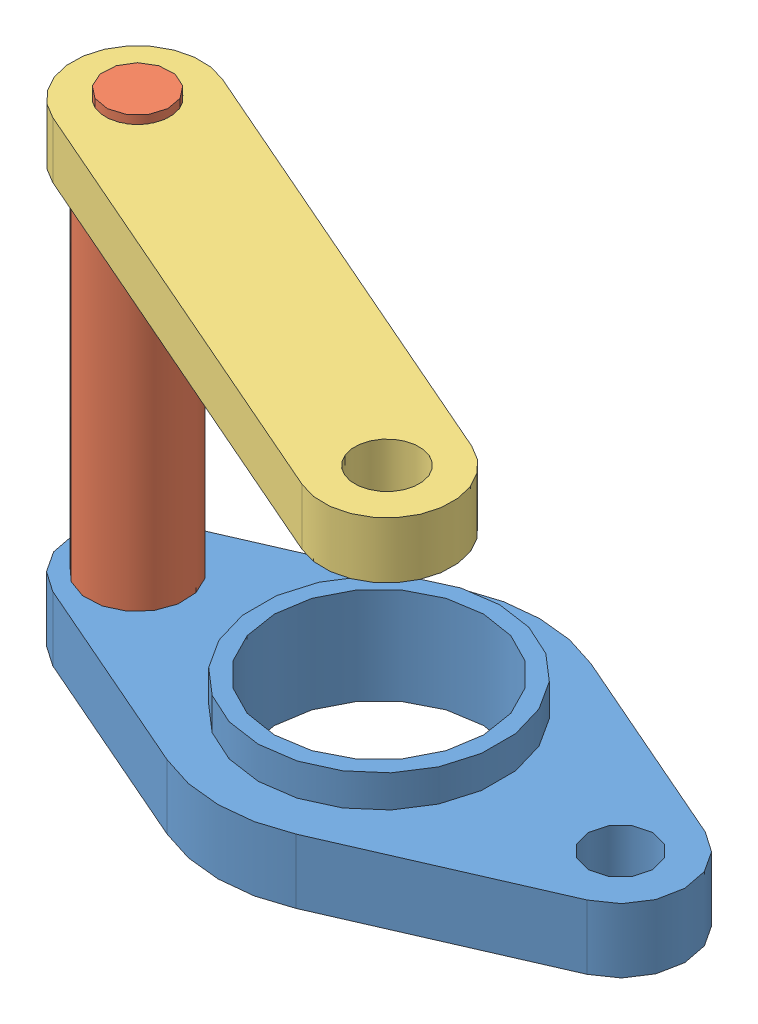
SolidWorks assembly Parallel constraint.SLDASM, configuration Default (file format 11000). Lengths in mm.
Overall size (196.33 150 136.33).
3 component instances, 3 part files, 5 mates.
Components (placement in the parent):
- base-1: base.SLDPRT [Default] at origin size (190 30 100)
- pin-1: pin.SLDPRT [Default] at (-10.804 0 38.7798) x (0.855947 0 0.517064) z (-0.517064 0 0.855947) size (30 150 30)
- upper link-1: upper link.SLDPRT [Default] at (-6.2614 130 30) x (-0.916515 0 -0.4) z (0 1 0) size (190 40 17.5)
Mates (geometry in assembly coordinates):
- Concentric1: concentric: cylinder of assembly; cylinder of assembly; cylinder of pin-1 through (-75 0 0) axis (0 -1 0) radius 10; cylinder of upper link-1 through (-75 147.5 0) axis (0 -1 0) radius 10
- Coincident7: coincident: plane of assembly; plane of assembly; plane of pin-1 through (-62.1608 130 7.756) normal (0 1 0); plane of upper link-1 through (-75 130 0) normal (0 -1 0)
- Concentric2: concentric: cylinder of assembly; cylinder of assembly; cylinder of base-1 through (-75 20 0) axis (0 -1 0) radius 10; cylinder of pin-1 through (-75 0 0) axis (0 -1 0) radius 10
- Coincident8: coincident: plane of assembly; plane of assembly; plane of base-1 through (-167.5297 20 0.5275) normal (0 1 0); plane of pin-1 through (-66.4405 20 5.1706) normal (0 -1 0)
- Parallel2: parallel: plane of assembly; plane of assembly; plane of base-1 through (-160.5315 20 -15.5072) normal (-0.4 0 0.916515); plane of upper link-1 through (-83 147.5 18.3303) normal (-0.4 0 0.916515)
